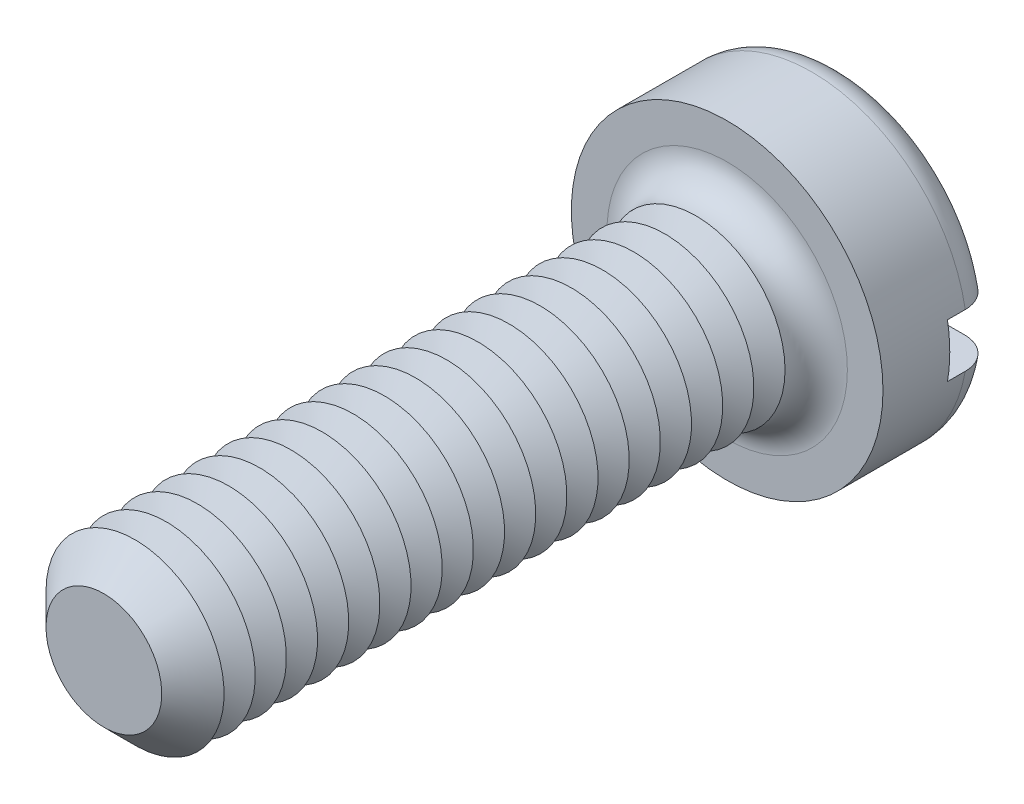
from build123d import *

# Parameters (mm, degrees)
SKETCH3_R           = 3.5
BOSS_EXTRUDE2_DEPTH = 2.6
SKETCH4_R           = 2
BOSS_EXTRUDE3_DEPTH = 14
FILLET1_R           = 0.7
CHAMFER1_SIZE       = 0.7
LPATTERN1_COUNT     = 18
LPATTERN1_PITCH     = 0.7
SKETCH8_W           = 7
SKETCH8_H           = 1.2
CUT_EXTRUDE1_DEPTH  = 1.1


with BuildPart() as part:
    # Sketch3 → Boss-Extrude2 (new body)
    with BuildSketch(Plane.XY):
        Circle(SKETCH3_R)
    extrude(amount=-BOSS_EXTRUDE2_DEPTH)

    # Sketch4 → Boss-Extrude3 (add)
    with BuildSketch(Plane.XY):
        Circle(SKETCH4_R)
    extrude(amount=BOSS_EXTRUDE3_DEPTH)

    # Fillet1
    fillet1_edges = [part.edges().sort_by_distance(p)[0] for p in [
        (-3.5, 0, -2.6),
        (-2, 0, 0),
    ]]
    fillet(fillet1_edges, radius=FILLET1_R)

    # Chamfer1
    chamfer1_edges = [part.edges().sort_by_distance(p)[0] for p in [
        (-2, 0, 14),
    ]]
    chamfer(chamfer1_edges, length=CHAMFER1_SIZE)

    # Sketch6 → Cut-Revolve1 (revolve, cut)
    with BuildSketch(Plane(origin=(0, 0, 0), x_dir=(0, 0, -1), z_dir=(1, 0, 0)), mode=Mode.PRIVATE) as cut_revolve1_sk:
        Polygon((-0.7, 2), (-1.05, 1.393782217), (-1.4, 2), align=None)
    cut_revolve1 = revolve(cut_revolve1_sk.sketch.rotate(Axis((0, 0, -1.694361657), (0, 0, 1)), 90), axis=Axis((0, 0, -1.694361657), (0, 0, 1)), mode=Mode.SUBTRACT)

    # LPattern1: Cut-Revolve1 ×18
    with Locations(*[(0, 0, i * LPATTERN1_PITCH) for i in range(1, LPATTERN1_COUNT)]):
        add(cut_revolve1, mode=Mode.SUBTRACT)

    # Sketch8 → Cut-Extrude1 (cut)
    with BuildSketch(Plane(origin=(0, 0, -2.6), x_dir=(-1, 0, 0), z_dir=(0, 0, -1))):
        Rectangle(SKETCH8_W, SKETCH8_H)
    extrude(amount=-CUT_EXTRUDE1_DEPTH, mode=Mode.SUBTRACT)


solid = part.part
